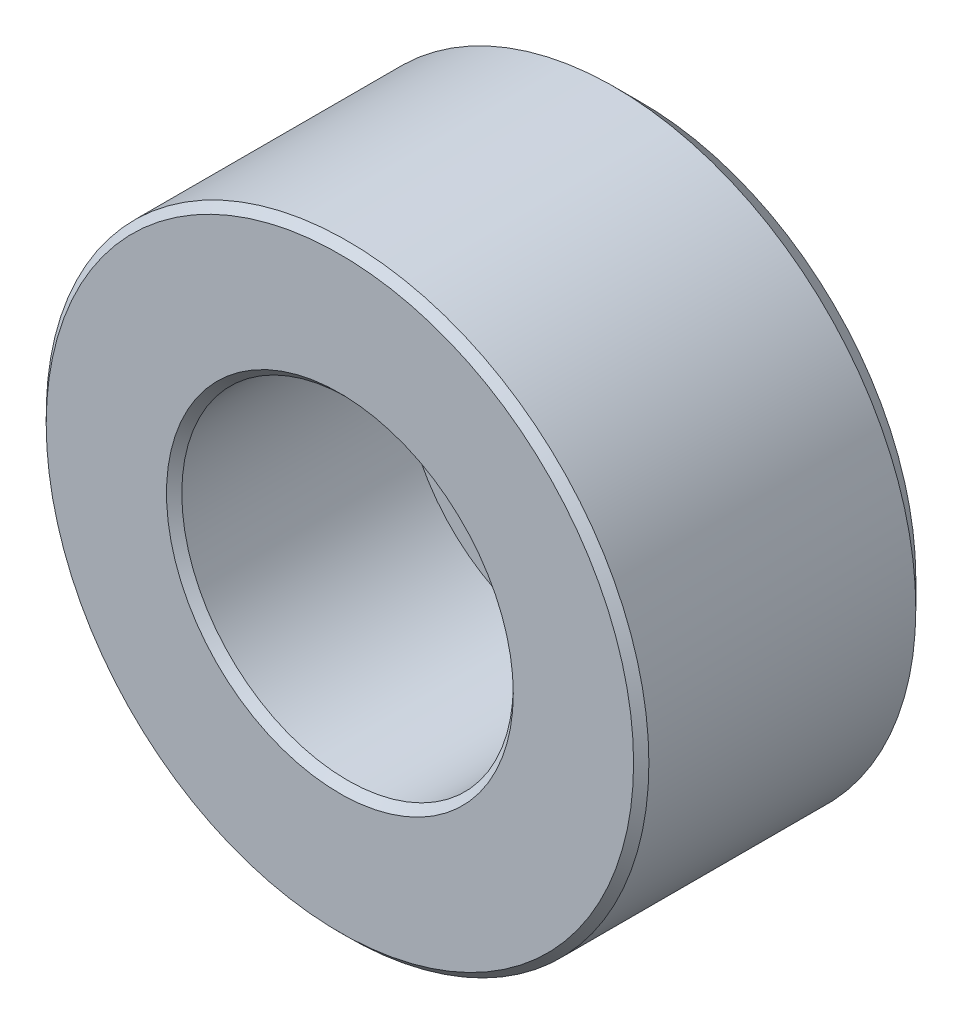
ISO-10303-21;
HEADER;
FILE_DESCRIPTION(('STEP AP214'),'2;1');
FILE_NAME('part.step','',(''),(''),'','','');
FILE_SCHEMA(('AUTOMOTIVE_DESIGN { 1 0 10303 214 1 1 1 1 }'));
ENDSEC;
DATA;
#1=APPLICATION_CONTEXT('core data for automotive mechanical design processes');
#2=APPLICATION_PROTOCOL_DEFINITION('international standard','automotive_design',2000,#1);
#3=PRODUCT_CONTEXT('',#1,'mechanical');
#4=PRODUCT('Part','Part','',(#3));
#5=PRODUCT_RELATED_PRODUCT_CATEGORY('part','',(#4));
#6=PRODUCT_DEFINITION_FORMATION('','',#4);
#7=PRODUCT_DEFINITION_CONTEXT('part definition',#1,'design');
#8=PRODUCT_DEFINITION('design','',#6,#7);
#9=PRODUCT_DEFINITION_SHAPE('','',#8);
#10=(LENGTH_UNIT() NAMED_UNIT(*) SI_UNIT(.MILLI.,.METRE.));
#11=(NAMED_UNIT(*) PLANE_ANGLE_UNIT() SI_UNIT($,.RADIAN.));
#12=(NAMED_UNIT(*) SI_UNIT($,.STERADIAN.) SOLID_ANGLE_UNIT());
#13=UNCERTAINTY_MEASURE_WITH_UNIT(LENGTH_MEASURE(1.E-05),#10,'distance_accuracy_value','');
#14=(GEOMETRIC_REPRESENTATION_CONTEXT(3) GLOBAL_UNCERTAINTY_ASSIGNED_CONTEXT((#13)) GLOBAL_UNIT_ASSIGNED_CONTEXT((#10,
#11,#12)) REPRESENTATION_CONTEXT('',''));
#15=CARTESIAN_POINT('',(0.,0.,0.));
#16=DIRECTION('',(0.,0.,1.));
#17=DIRECTION('',(1.,0.,0.));
#18=AXIS2_PLACEMENT_3D('',#15,#16,#17);
#19=CARTESIAN_POINT('',(0.,0.,10.));
#20=DIRECTION('',(0.,0.,1.));
#21=DIRECTION('',(1.,0.,0.));
#22=AXIS2_PLACEMENT_3D('',#19,#20,#21);
#23=CYLINDRICAL_SURFACE('',#22,3.3);
#24=CARTESIAN_POINT('',(0.,0.,0.254));
#25=DIRECTION('',(0.,0.,1.));
#26=DIRECTION('',(1.,0.,0.));
#27=AXIS2_PLACEMENT_3D('',#24,#25,#26);
#28=CIRCLE('',#27,3.3);
#29=CARTESIAN_POINT('',(3.3,0.,0.254));
#30=VERTEX_POINT('',#29);
#31=EDGE_CURVE('E8',#30,#30,#28,.F.);
#32=ORIENTED_EDGE('',*,*,#31,.T.);
#33=EDGE_LOOP('',(#32));
#34=FACE_BOUND('',#33,.T.);
#35=CARTESIAN_POINT('',(0.,0.,2.4));
#36=DIRECTION('',(0.,0.,1.));
#37=DIRECTION('',(1.,0.,0.));
#38=AXIS2_PLACEMENT_3D('',#35,#36,#37);
#39=CIRCLE('',#38,3.3);
#40=CARTESIAN_POINT('',(3.3,0.,2.4));
#41=VERTEX_POINT('',#40);
#42=EDGE_CURVE('E16',#41,#41,#39,.F.);
#43=ORIENTED_EDGE('',*,*,#42,.F.);
#44=EDGE_LOOP('',(#43));
#45=FACE_BOUND('',#44,.T.);
#46=ADVANCED_FACE('F12',(#34,#45),#23,.F.);
#47=CARTESIAN_POINT('',(0.,0.,0.));
#48=DIRECTION('',(0.,0.,1.));
#49=DIRECTION('',(1.,0.,0.));
#50=AXIS2_PLACEMENT_3D('',#47,#48,#49);
#51=CYLINDRICAL_SURFACE('',#50,10.);
#52=CARTESIAN_POINT('',(0.,0.,0.889));
#53=DIRECTION('',(0.,0.,1.));
#54=DIRECTION('',(1.,0.,0.));
#55=AXIS2_PLACEMENT_3D('',#52,#53,#54);
#56=CIRCLE('',#55,10.);
#57=CARTESIAN_POINT('',(10.,0.,0.889));
#58=VERTEX_POINT('',#57);
#59=EDGE_CURVE('E32',#58,#58,#56,.T.);
#60=ORIENTED_EDGE('',*,*,#59,.T.);
#61=EDGE_LOOP('',(#60));
#62=FACE_BOUND('',#61,.T.);
#63=CARTESIAN_POINT('',(0.,0.,9.746));
#64=DIRECTION('',(0.,0.,1.));
#65=DIRECTION('',(1.,0.,0.));
#66=AXIS2_PLACEMENT_3D('',#63,#64,#65);
#67=CIRCLE('',#66,10.);
#68=CARTESIAN_POINT('',(10.,0.,9.746));
#69=VERTEX_POINT('',#68);
#70=EDGE_CURVE('E35',#69,#69,#67,.F.);
#71=ORIENTED_EDGE('',*,*,#70,.T.);
#72=EDGE_LOOP('',(#71));
#73=FACE_BOUND('',#72,.T.);
#74=ADVANCED_FACE('F62',(#62,#73),#51,.T.);
#75=CARTESIAN_POINT('',(0.,0.,0.));
#76=DIRECTION('',(0.,0.,1.));
#77=DIRECTION('',(1.,0.,0.));
#78=AXIS2_PLACEMENT_3D('',#75,#76,#77);
#79=PLANE('',#78);
#80=CARTESIAN_POINT('',(0.,0.,0.));
#81=DIRECTION('',(0.,0.,1.));
#82=DIRECTION('',(1.,0.,0.));
#83=AXIS2_PLACEMENT_3D('',#80,#81,#82);
#84=CIRCLE('',#83,3.554);
#85=CARTESIAN_POINT('',(3.554,0.,0.));
#86=VERTEX_POINT('',#85);
#87=EDGE_CURVE('E20',#86,#86,#84,.T.);
#88=ORIENTED_EDGE('',*,*,#87,.T.);
#89=EDGE_LOOP('',(#88));
#90=FACE_BOUND('',#89,.T.);
#91=CARTESIAN_POINT('',(0.,0.,0.));
#92=DIRECTION('',(0.,0.,1.));
#93=DIRECTION('',(1.,0.,0.));
#94=AXIS2_PLACEMENT_3D('',#91,#92,#93);
#95=CIRCLE('',#94,9.111);
#96=CARTESIAN_POINT('',(9.111,0.,0.));
#97=VERTEX_POINT('',#96);
#98=EDGE_CURVE('E29',#97,#97,#95,.F.);
#99=ORIENTED_EDGE('',*,*,#98,.T.);
#100=EDGE_LOOP('',(#99));
#101=FACE_BOUND('',#100,.T.);
#102=ADVANCED_FACE('F66',(#90,#101),#79,.F.);
#103=CARTESIAN_POINT('',(0.,0.,10.));
#104=DIRECTION('',(0.,0.,1.));
#105=DIRECTION('',(1.,0.,0.));
#106=AXIS2_PLACEMENT_3D('',#103,#104,#105);
#107=PLANE('',#106);
#108=CARTESIAN_POINT('',(0.,0.,10.));
#109=DIRECTION('',(0.,0.,1.));
#110=DIRECTION('',(1.,0.,0.));
#111=AXIS2_PLACEMENT_3D('',#108,#109,#110);
#112=CIRCLE('',#111,5.754);
#113=CARTESIAN_POINT('',(5.754,0.,10.));
#114=VERTEX_POINT('',#113);
#115=EDGE_CURVE('E24',#114,#114,#112,.F.);
#116=ORIENTED_EDGE('',*,*,#115,.T.);
#117=EDGE_LOOP('',(#116));
#118=FACE_BOUND('',#117,.T.);
#119=CARTESIAN_POINT('',(0.,0.,10.));
#120=DIRECTION('',(0.,0.,1.));
#121=DIRECTION('',(1.,0.,0.));
#122=AXIS2_PLACEMENT_3D('',#119,#120,#121);
#123=CIRCLE('',#122,9.746);
#124=CARTESIAN_POINT('',(9.746,0.,10.));
#125=VERTEX_POINT('',#124);
#126=EDGE_CURVE('E38',#125,#125,#123,.T.);
#127=ORIENTED_EDGE('',*,*,#126,.T.);
#128=EDGE_LOOP('',(#127));
#129=FACE_BOUND('',#128,.T.);
#130=ADVANCED_FACE('F73',(#118,#129),#107,.T.);
#131=CARTESIAN_POINT('',(0.,0.,10.));
#132=DIRECTION('',(0.,0.,-1.));
#133=DIRECTION('',(-1.,0.,0.));
#134=AXIS2_PLACEMENT_3D('',#131,#132,#133);
#135=CONICAL_SURFACE('',#134,9.746,0.785398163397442);
#136=ORIENTED_EDGE('',*,*,#70,.F.);
#137=EDGE_LOOP('',(#136));
#138=FACE_BOUND('',#137,.T.);
#139=ORIENTED_EDGE('',*,*,#126,.F.);
#140=EDGE_LOOP('',(#139));
#141=FACE_BOUND('',#140,.T.);
#142=ADVANCED_FACE('F76',(#138,#141),#135,.T.);
#143=CARTESIAN_POINT('',(0.,0.,0.889));
#144=DIRECTION('',(0.,0.,1.));
#145=DIRECTION('',(1.,0.,0.));
#146=AXIS2_PLACEMENT_3D('',#143,#144,#145);
#147=CONICAL_SURFACE('',#146,10.,0.785398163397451);
#148=ORIENTED_EDGE('',*,*,#98,.F.);
#149=EDGE_LOOP('',(#148));
#150=FACE_BOUND('',#149,.T.);
#151=ORIENTED_EDGE('',*,*,#59,.F.);
#152=EDGE_LOOP('',(#151));
#153=FACE_BOUND('',#152,.T.);
#154=ADVANCED_FACE('F81',(#150,#153),#147,.T.);
#155=CARTESIAN_POINT('',(0.,0.,9.746));
#156=DIRECTION('',(0.,0.,1.));
#157=DIRECTION('',(1.,0.,0.));
#158=AXIS2_PLACEMENT_3D('',#155,#156,#157);
#159=CONICAL_SURFACE('',#158,5.5,0.785398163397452);
#160=ORIENTED_EDGE('',*,*,#115,.F.);
#161=EDGE_LOOP('',(#160));
#162=FACE_BOUND('',#161,.T.);
#163=CARTESIAN_POINT('',(0.,0.,9.746));
#164=DIRECTION('',(0.,0.,1.));
#165=DIRECTION('',(1.,0.,0.));
#166=AXIS2_PLACEMENT_3D('',#163,#164,#165);
#167=CIRCLE('',#166,5.5);
#168=CARTESIAN_POINT('',(5.5,0.,9.746));
#169=VERTEX_POINT('',#168);
#170=EDGE_CURVE('E41',#169,#169,#167,.T.);
#171=ORIENTED_EDGE('',*,*,#170,.F.);
#172=EDGE_LOOP('',(#171));
#173=FACE_BOUND('',#172,.T.);
#174=ADVANCED_FACE('F84',(#162,#173),#159,.F.);
#175=CARTESIAN_POINT('',(0.,0.,0.));
#176=DIRECTION('',(0.,0.,-1.));
#177=DIRECTION('',(-1.,0.,0.));
#178=AXIS2_PLACEMENT_3D('',#175,#176,#177);
#179=CONICAL_SURFACE('',#178,3.554,0.785398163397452);
#180=ORIENTED_EDGE('',*,*,#31,.F.);
#181=EDGE_LOOP('',(#180));
#182=FACE_BOUND('',#181,.T.);
#183=ORIENTED_EDGE('',*,*,#87,.F.);
#184=EDGE_LOOP('',(#183));
#185=FACE_BOUND('',#184,.T.);
#186=ADVANCED_FACE('F14',(#182,#185),#179,.F.);
#187=CARTESIAN_POINT('',(0.,0.,2.4));
#188=DIRECTION('',(0.,0.,1.));
#189=DIRECTION('',(1.,0.,0.));
#190=AXIS2_PLACEMENT_3D('',#187,#188,#189);
#191=PLANE('',#190);
#192=CARTESIAN_POINT('',(0.,0.,2.4));
#193=DIRECTION('',(0.,0.,1.));
#194=DIRECTION('',(1.,0.,0.));
#195=AXIS2_PLACEMENT_3D('',#192,#193,#194);
#196=CIRCLE('',#195,5.5);
#197=CARTESIAN_POINT('',(5.5,0.,2.4));
#198=VERTEX_POINT('',#197);
#199=EDGE_CURVE('E44',#198,#198,#196,.T.);
#200=ORIENTED_EDGE('',*,*,#199,.T.);
#201=EDGE_LOOP('',(#200));
#202=FACE_BOUND('',#201,.T.);
#203=ORIENTED_EDGE('',*,*,#42,.T.);
#204=EDGE_LOOP('',(#203));
#205=FACE_BOUND('',#204,.T.);
#206=ADVANCED_FACE('F48',(#202,#205),#191,.T.);
#207=CARTESIAN_POINT('',(0.,0.,2.4));
#208=DIRECTION('',(0.,0.,1.));
#209=DIRECTION('',(1.,0.,0.));
#210=AXIS2_PLACEMENT_3D('',#207,#208,#209);
#211=CYLINDRICAL_SURFACE('',#210,5.5);
#212=ORIENTED_EDGE('',*,*,#170,.T.);
#213=EDGE_LOOP('',(#212));
#214=FACE_BOUND('',#213,.T.);
#215=ORIENTED_EDGE('',*,*,#199,.F.);
#216=EDGE_LOOP('',(#215));
#217=FACE_BOUND('',#216,.T.);
#218=ADVANCED_FACE('F51',(#214,#217),#211,.F.);
#219=CLOSED_SHELL('',(#46,#74,#102,#130,#142,#154,#174,#186,#206,#218));
#220=MANIFOLD_SOLID_BREP('B1',#219);
#221=ADVANCED_BREP_SHAPE_REPRESENTATION('',(#18,#220),#14);
#222=SHAPE_DEFINITION_REPRESENTATION(#9,#221);
ENDSEC;
END-ISO-10303-21;
